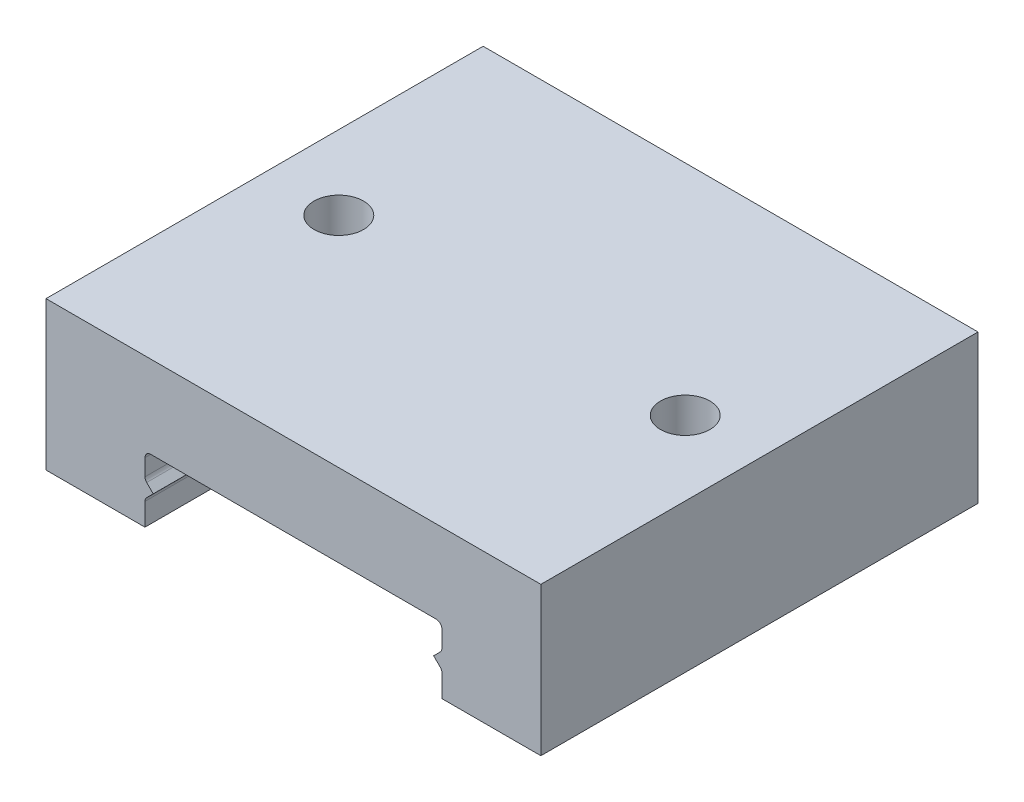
ISO-10303-21;
HEADER;
FILE_DESCRIPTION(('STEP AP214'),'2;1');
FILE_NAME('part.step','',(''),(''),'','','');
FILE_SCHEMA(('AUTOMOTIVE_DESIGN { 1 0 10303 214 1 1 1 1 }'));
ENDSEC;
DATA;
#1=APPLICATION_CONTEXT('core data for automotive mechanical design processes');
#2=APPLICATION_PROTOCOL_DEFINITION('international standard','automotive_design',2000,#1);
#3=PRODUCT_CONTEXT('',#1,'mechanical');
#4=PRODUCT('Part','Part','',(#3));
#5=PRODUCT_RELATED_PRODUCT_CATEGORY('part','',(#4));
#6=PRODUCT_DEFINITION_FORMATION('','',#4);
#7=PRODUCT_DEFINITION_CONTEXT('part definition',#1,'design');
#8=PRODUCT_DEFINITION('design','',#6,#7);
#9=PRODUCT_DEFINITION_SHAPE('','',#8);
#10=(LENGTH_UNIT() NAMED_UNIT(*) SI_UNIT(.MILLI.,.METRE.));
#11=(NAMED_UNIT(*) PLANE_ANGLE_UNIT() SI_UNIT($,.RADIAN.));
#12=(NAMED_UNIT(*) SI_UNIT($,.STERADIAN.) SOLID_ANGLE_UNIT());
#13=UNCERTAINTY_MEASURE_WITH_UNIT(LENGTH_MEASURE(1.E-05),#10,'distance_accuracy_value','');
#14=(GEOMETRIC_REPRESENTATION_CONTEXT(3) GLOBAL_UNCERTAINTY_ASSIGNED_CONTEXT((#13)) GLOBAL_UNIT_ASSIGNED_CONTEXT((#10,
#11,#12)) REPRESENTATION_CONTEXT('',''));
#15=CARTESIAN_POINT('',(0.,0.,0.));
#16=DIRECTION('',(0.,0.,1.));
#17=DIRECTION('',(1.,0.,0.));
#18=AXIS2_PLACEMENT_3D('',#15,#16,#17);
#19=CARTESIAN_POINT('',(-15.0000000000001,3.00000000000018,26.5));
#20=DIRECTION('',(0.,1.,0.));
#21=DIRECTION('',(0.,0.,1.));
#22=AXIS2_PLACEMENT_3D('',#19,#20,#21);
#23=PLANE('',#22);
#24=DIRECTION('',(0.,0.,1.));
#25=VECTOR('',#24,1.);
#26=CARTESIAN_POINT('',(8.99999999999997,3.00000000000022,26.5));
#27=LINE('',#26,#25);
#28=CARTESIAN_POINT('',(9.,3.00000000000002,0.));
#29=VERTEX_POINT('',#28);
#30=CARTESIAN_POINT('',(8.99999999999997,3.00000000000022,26.5));
#31=VERTEX_POINT('',#30);
#32=EDGE_CURVE('E239',#29,#31,#27,.T.);
#33=ORIENTED_EDGE('',*,*,#32,.F.);
#34=DIRECTION('',(1.,0.,0.));
#35=VECTOR('',#34,1.);
#36=CARTESIAN_POINT('',(-15.,3.00000000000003,0.));
#37=LINE('',#36,#35);
#38=CARTESIAN_POINT('',(15.,3.,0.));
#39=VERTEX_POINT('',#38);
#40=EDGE_CURVE('E275',#29,#39,#37,.T.);
#41=ORIENTED_EDGE('',*,*,#40,.T.);
#42=DIRECTION('',(0.,0.,-1.));
#43=VECTOR('',#42,1.);
#44=CARTESIAN_POINT('',(15.,2.99999999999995,26.5));
#45=LINE('',#44,#43);
#46=CARTESIAN_POINT('',(15.,2.99999999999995,26.5));
#47=VERTEX_POINT('',#46);
#48=EDGE_CURVE('E300',#47,#39,#45,.T.);
#49=ORIENTED_EDGE('',*,*,#48,.F.);
#50=DIRECTION('',(1.,0.,0.));
#51=VECTOR('',#50,1.);
#52=CARTESIAN_POINT('',(-15.0000000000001,3.00000000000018,26.5));
#53=LINE('',#52,#51);
#54=EDGE_CURVE('E286',#31,#47,#53,.T.);
#55=ORIENTED_EDGE('',*,*,#54,.F.);
#56=EDGE_LOOP('',(#33,#41,#49,#55));
#57=FACE_BOUND('',#56,.T.);
#58=ADVANCED_FACE('F42',(#57),#23,.F.);
#59=CARTESIAN_POINT('',(-15.0000000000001,3.00000000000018,26.5));
#60=DIRECTION('',(0.,0.,1.));
#61=DIRECTION('',(1.,0.,0.));
#62=AXIS2_PLACEMENT_3D('',#59,#60,#61);
#63=PLANE('',#62);
#64=DIRECTION('',(-0.707106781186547,0.707106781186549,0.));
#65=VECTOR('',#64,1.);
#66=CARTESIAN_POINT('',(8.49999999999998,5.00000000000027,26.5));
#67=LINE('',#66,#65);
#68=CARTESIAN_POINT('',(8.89748737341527,4.60251262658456,26.5));
#69=VERTEX_POINT('',#68);
#70=CARTESIAN_POINT('',(8.49999999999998,5.00000000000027,26.5));
#71=VERTEX_POINT('',#70);
#72=EDGE_CURVE('E231',#69,#71,#67,.T.);
#73=ORIENTED_EDGE('',*,*,#72,.F.);
#74=CARTESIAN_POINT('',(8.65000000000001,4.3550252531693,26.5));
#75=DIRECTION('',(0.,0.,1.));
#76=DIRECTION('',(1.,0.,0.));
#77=AXIS2_PLACEMENT_3D('',#74,#75,#76);
#78=CIRCLE('',#77,0.35);
#79=CARTESIAN_POINT('',(8.99999999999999,4.35502525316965,26.5));
#80=VERTEX_POINT('',#79);
#81=EDGE_CURVE('E351',#69,#80,#78,.F.);
#82=ORIENTED_EDGE('',*,*,#81,.T.);
#83=DIRECTION('',(0.,1.,0.));
#84=VECTOR('',#83,1.);
#85=CARTESIAN_POINT('',(9.,0.830210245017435,26.5));
#86=LINE('',#85,#84);
#87=EDGE_CURVE('E233',#31,#80,#86,.T.);
#88=ORIENTED_EDGE('',*,*,#87,.F.);
#89=ORIENTED_EDGE('',*,*,#54,.T.);
#90=DIRECTION('',(0.,1.,0.));
#91=VECTOR('',#90,1.);
#92=CARTESIAN_POINT('',(15.,12.0000000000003,26.5000000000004));
#93=LINE('',#92,#91);
#94=CARTESIAN_POINT('',(15.,12.0000000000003,26.5000000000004));
#95=VERTEX_POINT('',#94);
#96=EDGE_CURVE('E290',#47,#95,#93,.T.);
#97=ORIENTED_EDGE('',*,*,#96,.T.);
#98=DIRECTION('',(-1.,0.,0.));
#99=VECTOR('',#98,1.);
#100=CARTESIAN_POINT('',(-15.,12.,26.5000000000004));
#101=LINE('',#100,#99);
#102=CARTESIAN_POINT('',(-15.,12.,26.5000000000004));
#103=VERTEX_POINT('',#102);
#104=EDGE_CURVE('E292',#95,#103,#101,.T.);
#105=ORIENTED_EDGE('',*,*,#104,.T.);
#106=DIRECTION('',(0.,-1.,0.));
#107=VECTOR('',#106,1.);
#108=CARTESIAN_POINT('',(-15.,12.,26.5000000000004));
#109=LINE('',#108,#107);
#110=CARTESIAN_POINT('',(-15.0000000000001,3.00000000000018,26.5));
#111=VERTEX_POINT('',#110);
#112=EDGE_CURVE('E283',#103,#111,#109,.T.);
#113=ORIENTED_EDGE('',*,*,#112,.T.);
#114=CARTESIAN_POINT('',(-8.99999999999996,3.0000000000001,26.5));
#115=VERTEX_POINT('',#114);
#116=EDGE_CURVE('E287',#111,#115,#53,.T.);
#117=ORIENTED_EDGE('',*,*,#116,.T.);
#118=DIRECTION('',(0.,1.,0.));
#119=VECTOR('',#118,1.);
#120=CARTESIAN_POINT('',(-8.99999999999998,0.830210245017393,26.5));
#121=LINE('',#120,#119);
#122=CARTESIAN_POINT('',(-8.99999999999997,4.35502525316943,26.5));
#123=VERTEX_POINT('',#122);
#124=EDGE_CURVE('E252',#115,#123,#121,.T.);
#125=ORIENTED_EDGE('',*,*,#124,.T.);
#126=CARTESIAN_POINT('',(-8.65000000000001,4.35502525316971,26.5));
#127=DIRECTION('',(0.,0.,1.));
#128=DIRECTION('',(1.,0.,0.));
#129=AXIS2_PLACEMENT_3D('',#126,#127,#128);
#130=CIRCLE('',#129,0.35);
#131=CARTESIAN_POINT('',(-8.89748737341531,4.60251262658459,26.5));
#132=VERTEX_POINT('',#131);
#133=EDGE_CURVE('E325',#123,#132,#130,.F.);
#134=ORIENTED_EDGE('',*,*,#133,.T.);
#135=DIRECTION('',(0.707106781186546,0.707106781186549,0.));
#136=VECTOR('',#135,1.);
#137=CARTESIAN_POINT('',(-8.5,5.00000000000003,26.5));
#138=LINE('',#137,#136);
#139=CARTESIAN_POINT('',(-8.5,5.00000000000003,26.5));
#140=VERTEX_POINT('',#139);
#141=EDGE_CURVE('E255',#132,#140,#138,.T.);
#142=ORIENTED_EDGE('',*,*,#141,.T.);
#143=DIRECTION('',(-0.707106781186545,0.707106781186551,0.));
#144=VECTOR('',#143,1.);
#145=CARTESIAN_POINT('',(-8.99999999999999,5.50000000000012,26.5));
#146=LINE('',#145,#144);
#147=CARTESIAN_POINT('',(-8.89748737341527,5.39748737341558,26.5));
#148=VERTEX_POINT('',#147);
#149=EDGE_CURVE('E257',#140,#148,#146,.T.);
#150=ORIENTED_EDGE('',*,*,#149,.T.);
#151=CARTESIAN_POINT('',(-8.64999999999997,5.64497474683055,26.5));
#152=DIRECTION('',(0.,0.,1.));
#153=DIRECTION('',(1.,0.,0.));
#154=AXIS2_PLACEMENT_3D('',#151,#152,#153);
#155=CIRCLE('',#154,0.35);
#156=CARTESIAN_POINT('',(-9.00000000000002,5.64497474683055,26.5));
#157=VERTEX_POINT('',#156);
#158=EDGE_CURVE('E333',#148,#157,#155,.F.);
#159=ORIENTED_EDGE('',*,*,#158,.T.);
#160=DIRECTION('',(0.,1.,0.));
#161=VECTOR('',#160,1.);
#162=CARTESIAN_POINT('',(-9.00000000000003,7.00000000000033,26.5000000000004));
#163=LINE('',#162,#161);
#164=CARTESIAN_POINT('',(-8.99999999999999,6.64999999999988,26.5000000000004));
#165=VERTEX_POINT('',#164);
#166=EDGE_CURVE('E260',#157,#165,#163,.T.);
#167=ORIENTED_EDGE('',*,*,#166,.T.);
#168=CARTESIAN_POINT('',(-8.65000000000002,6.65000000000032,26.5000000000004));
#169=DIRECTION('',(0.,0.,1.));
#170=DIRECTION('',(1.,0.,0.));
#171=AXIS2_PLACEMENT_3D('',#168,#169,#170);
#172=CIRCLE('',#171,0.35);
#173=CARTESIAN_POINT('',(-8.65000000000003,7.00000000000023,26.5000000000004));
#174=VERTEX_POINT('',#173);
#175=EDGE_CURVE('E329',#165,#174,#172,.F.);
#176=ORIENTED_EDGE('',*,*,#175,.T.);
#177=DIRECTION('',(1.,0.,0.));
#178=VECTOR('',#177,1.);
#179=CARTESIAN_POINT('',(0.,7.00000000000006,26.5000000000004));
#180=LINE('',#179,#178);
#181=CARTESIAN_POINT('',(8.65000000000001,7.0000000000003,26.5000000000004));
#182=VERTEX_POINT('',#181);
#183=EDGE_CURVE('E263',#174,#182,#180,.T.);
#184=ORIENTED_EDGE('',*,*,#183,.T.);
#185=CARTESIAN_POINT('',(8.65000000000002,6.64999999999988,26.5000000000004));
#186=DIRECTION('',(0.,0.,1.));
#187=DIRECTION('',(1.,0.,0.));
#188=AXIS2_PLACEMENT_3D('',#185,#186,#187);
#189=CIRCLE('',#188,0.35);
#190=CARTESIAN_POINT('',(9.00000000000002,6.65000000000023,26.5000000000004));
#191=VERTEX_POINT('',#190);
#192=EDGE_CURVE('E355',#182,#191,#189,.F.);
#193=ORIENTED_EDGE('',*,*,#192,.T.);
#194=DIRECTION('',(0.,1.,0.));
#195=VECTOR('',#194,1.);
#196=CARTESIAN_POINT('',(9.00000000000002,6.9999999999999,26.5000000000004));
#197=LINE('',#196,#195);
#198=CARTESIAN_POINT('',(8.99999999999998,5.64497474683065,26.5));
#199=VERTEX_POINT('',#198);
#200=EDGE_CURVE('E226',#199,#191,#197,.T.);
#201=ORIENTED_EDGE('',*,*,#200,.F.);
#202=CARTESIAN_POINT('',(8.65,5.64497474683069,26.5));
#203=DIRECTION('',(0.,0.,1.));
#204=DIRECTION('',(1.,0.,0.));
#205=AXIS2_PLACEMENT_3D('',#202,#203,#204);
#206=CIRCLE('',#205,0.35);
#207=CARTESIAN_POINT('',(8.89748737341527,5.39748737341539,26.5));
#208=VERTEX_POINT('',#207);
#209=EDGE_CURVE('E13',#199,#208,#206,.F.);
#210=ORIENTED_EDGE('',*,*,#209,.T.);
#211=DIRECTION('',(0.707106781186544,0.707106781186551,0.));
#212=VECTOR('',#211,1.);
#213=CARTESIAN_POINT('',(8.99999999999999,5.49999999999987,26.5));
#214=LINE('',#213,#212);
#215=EDGE_CURVE('E229',#71,#208,#214,.T.);
#216=ORIENTED_EDGE('',*,*,#215,.F.);
#217=EDGE_LOOP('',(#73,#82,#88,#89,#97,#105,#113,#117,#125,#134,#142,#150,#159,#167,#176,#184,
#193,#201,#210,#216));
#218=FACE_BOUND('',#217,.T.);
#219=ADVANCED_FACE('F368',(#218),#63,.T.);
#220=CARTESIAN_POINT('',(-15.,3.00000000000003,0.));
#221=DIRECTION('',(0.,0.,1.));
#222=DIRECTION('',(1.,0.,0.));
#223=AXIS2_PLACEMENT_3D('',#220,#221,#222);
#224=PLANE('',#223);
#225=DIRECTION('',(0.,1.,0.));
#226=VECTOR('',#225,1.);
#227=CARTESIAN_POINT('',(8.99999999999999,0.830210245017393,0.));
#228=LINE('',#227,#226);
#229=CARTESIAN_POINT('',(9.,4.35502525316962,0.));
#230=VERTEX_POINT('',#229);
#231=EDGE_CURVE('E223',#29,#230,#228,.T.);
#232=ORIENTED_EDGE('',*,*,#231,.T.);
#233=CARTESIAN_POINT('',(8.65,4.35502525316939,0.));
#234=DIRECTION('',(0.,0.,1.));
#235=DIRECTION('',(1.,0.,0.));
#236=AXIS2_PLACEMENT_3D('',#233,#234,#235);
#237=CIRCLE('',#236,0.35);
#238=CARTESIAN_POINT('',(8.89748737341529,4.60251262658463,0.));
#239=VERTEX_POINT('',#238);
#240=EDGE_CURVE('E349',#230,#239,#237,.T.);
#241=ORIENTED_EDGE('',*,*,#240,.T.);
#242=DIRECTION('',(-0.707106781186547,0.707106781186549,0.));
#243=VECTOR('',#242,1.);
#244=CARTESIAN_POINT('',(8.5,5.00000000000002,0.));
#245=LINE('',#244,#243);
#246=CARTESIAN_POINT('',(8.5,5.00000000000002,0.));
#247=VERTEX_POINT('',#246);
#248=EDGE_CURVE('E221',#239,#247,#245,.T.);
#249=ORIENTED_EDGE('',*,*,#248,.T.);
#250=DIRECTION('',(0.707106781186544,0.707106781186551,0.));
#251=VECTOR('',#250,1.);
#252=CARTESIAN_POINT('',(8.99999999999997,5.49999999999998,0.));
#253=LINE('',#252,#251);
#254=CARTESIAN_POINT('',(8.8974873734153,5.39748737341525,0.));
#255=VERTEX_POINT('',#254);
#256=EDGE_CURVE('E218',#247,#255,#253,.T.);
#257=ORIENTED_EDGE('',*,*,#256,.T.);
#258=CARTESIAN_POINT('',(8.64999999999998,5.64497474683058,0.));
#259=DIRECTION('',(0.,0.,1.));
#260=DIRECTION('',(1.,0.,0.));
#261=AXIS2_PLACEMENT_3D('',#258,#259,#260);
#262=CIRCLE('',#261,0.35);
#263=CARTESIAN_POINT('',(9.00000000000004,5.64497474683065,0.));
#264=VERTEX_POINT('',#263);
#265=EDGE_CURVE('E50',#255,#264,#262,.T.);
#266=ORIENTED_EDGE('',*,*,#265,.T.);
#267=DIRECTION('',(0.,1.,0.));
#268=VECTOR('',#267,1.);
#269=CARTESIAN_POINT('',(9.,7.00000000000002,4.44089209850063E-13));
#270=LINE('',#269,#268);
#271=CARTESIAN_POINT('',(9.00000000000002,6.65000000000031,4.44089209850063E-13));
#272=VERTEX_POINT('',#271);
#273=EDGE_CURVE('E215',#264,#272,#270,.T.);
#274=ORIENTED_EDGE('',*,*,#273,.T.);
#275=CARTESIAN_POINT('',(8.64999999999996,6.65000000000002,4.44089209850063E-13));
#276=DIRECTION('',(0.,0.,1.));
#277=DIRECTION('',(1.,0.,0.));
#278=AXIS2_PLACEMENT_3D('',#275,#276,#277);
#279=CIRCLE('',#278,0.35);
#280=CARTESIAN_POINT('',(8.65,6.99999999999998,4.44089209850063E-13));
#281=VERTEX_POINT('',#280);
#282=EDGE_CURVE('E353',#272,#281,#279,.T.);
#283=ORIENTED_EDGE('',*,*,#282,.T.);
#284=DIRECTION('',(1.,0.,0.));
#285=VECTOR('',#284,1.);
#286=CARTESIAN_POINT('',(0.,7.00000000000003,4.44089209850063E-13));
#287=LINE('',#286,#285);
#288=CARTESIAN_POINT('',(-8.65000000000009,7.00000000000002,4.44089209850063E-13));
#289=VERTEX_POINT('',#288);
#290=EDGE_CURVE('E249',#289,#281,#287,.T.);
#291=ORIENTED_EDGE('',*,*,#290,.F.);
#292=CARTESIAN_POINT('',(-8.64999999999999,6.65,4.44089209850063E-13));
#293=DIRECTION('',(0.,0.,1.));
#294=DIRECTION('',(1.,0.,0.));
#295=AXIS2_PLACEMENT_3D('',#292,#293,#294);
#296=CIRCLE('',#295,0.35);
#297=CARTESIAN_POINT('',(-9.00000000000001,6.64999999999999,4.44089209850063E-13));
#298=VERTEX_POINT('',#297);
#299=EDGE_CURVE('E327',#289,#298,#296,.T.);
#300=ORIENTED_EDGE('',*,*,#299,.T.);
#301=DIRECTION('',(0.,1.,0.));
#302=VECTOR('',#301,1.);
#303=CARTESIAN_POINT('',(-8.99999999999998,6.99999999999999,4.44089209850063E-13));
#304=LINE('',#303,#302);
#305=CARTESIAN_POINT('',(-9.00000000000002,5.64497474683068,0.));
#306=VERTEX_POINT('',#305);
#307=EDGE_CURVE('E246',#306,#298,#304,.T.);
#308=ORIENTED_EDGE('',*,*,#307,.F.);
#309=CARTESIAN_POINT('',(-8.64999999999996,5.64497474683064,0.));
#310=DIRECTION('',(0.,0.,1.));
#311=DIRECTION('',(1.,0.,0.));
#312=AXIS2_PLACEMENT_3D('',#309,#310,#311);
#313=CIRCLE('',#312,0.35);
#314=CARTESIAN_POINT('',(-8.89748737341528,5.39748737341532,0.));
#315=VERTEX_POINT('',#314);
#316=EDGE_CURVE('E331',#306,#315,#313,.T.);
#317=ORIENTED_EDGE('',*,*,#316,.T.);
#318=DIRECTION('',(-0.707106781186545,0.707106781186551,0.));
#319=VECTOR('',#318,1.);
#320=CARTESIAN_POINT('',(-9.00000000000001,5.49999999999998,0.));
#321=LINE('',#320,#319);
#322=CARTESIAN_POINT('',(-8.50000000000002,5.00000000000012,0.));
#323=VERTEX_POINT('',#322);
#324=EDGE_CURVE('E243',#323,#315,#321,.T.);
#325=ORIENTED_EDGE('',*,*,#324,.F.);
#326=DIRECTION('',(0.707106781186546,0.707106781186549,0.));
#327=VECTOR('',#326,1.);
#328=CARTESIAN_POINT('',(-8.50000000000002,5.00000000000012,0.));
#329=LINE('',#328,#327);
#330=CARTESIAN_POINT('',(-8.89748737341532,4.60251262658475,0.));
#331=VERTEX_POINT('',#330);
#332=EDGE_CURVE('E241',#331,#323,#329,.T.);
#333=ORIENTED_EDGE('',*,*,#332,.F.);
#334=CARTESIAN_POINT('',(-8.65000000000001,4.35502525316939,0.));
#335=DIRECTION('',(0.,0.,1.));
#336=DIRECTION('',(1.,0.,0.));
#337=AXIS2_PLACEMENT_3D('',#334,#335,#336);
#338=CIRCLE('',#337,0.35);
#339=CARTESIAN_POINT('',(-8.99999999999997,4.35502525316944,0.));
#340=VERTEX_POINT('',#339);
#341=EDGE_CURVE('E323',#331,#340,#338,.T.);
#342=ORIENTED_EDGE('',*,*,#341,.T.);
#343=DIRECTION('',(0.,-1.,0.));
#344=VECTOR('',#343,1.);
#345=CARTESIAN_POINT('',(-8.99999999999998,3.,0.));
#346=LINE('',#345,#344);
#347=CARTESIAN_POINT('',(-8.99999999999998,3.,0.));
#348=VERTEX_POINT('',#347);
#349=EDGE_CURVE('E306',#340,#348,#346,.T.);
#350=ORIENTED_EDGE('',*,*,#349,.T.);
#351=CARTESIAN_POINT('',(-15.,3.00000000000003,0.));
#352=VERTEX_POINT('',#351);
#353=EDGE_CURVE('E276',#352,#348,#37,.T.);
#354=ORIENTED_EDGE('',*,*,#353,.F.);
#355=DIRECTION('',(0.,-1.,0.));
#356=VECTOR('',#355,1.);
#357=CARTESIAN_POINT('',(-15.,12.0000000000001,4.44089209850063E-13));
#358=LINE('',#357,#356);
#359=CARTESIAN_POINT('',(-15.,12.0000000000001,4.44089209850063E-13));
#360=VERTEX_POINT('',#359);
#361=EDGE_CURVE('E272',#360,#352,#358,.T.);
#362=ORIENTED_EDGE('',*,*,#361,.F.);
#363=DIRECTION('',(-1.,0.,0.));
#364=VECTOR('',#363,1.);
#365=CARTESIAN_POINT('',(-15.,12.0000000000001,4.44089209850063E-13));
#366=LINE('',#365,#364);
#367=CARTESIAN_POINT('',(15.,12.0000000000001,4.44089209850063E-13));
#368=VERTEX_POINT('',#367);
#369=EDGE_CURVE('E281',#368,#360,#366,.T.);
#370=ORIENTED_EDGE('',*,*,#369,.F.);
#371=DIRECTION('',(0.,1.,0.));
#372=VECTOR('',#371,1.);
#373=CARTESIAN_POINT('',(15.,12.0000000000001,4.44089209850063E-13));
#374=LINE('',#373,#372);
#375=EDGE_CURVE('E279',#39,#368,#374,.T.);
#376=ORIENTED_EDGE('',*,*,#375,.F.);
#377=ORIENTED_EDGE('',*,*,#40,.F.);
#378=EDGE_LOOP('',(#232,#241,#249,#257,#266,#274,#283,#291,#300,#308,#317,#325,#333,#342,#350,
#354,#362,#370,#376,#377));
#379=FACE_BOUND('',#378,.T.);
#380=ADVANCED_FACE('F358',(#379),#224,.F.);
#381=CARTESIAN_POINT('',(-15.,12.,26.5000000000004));
#382=DIRECTION('',(1.,0.,0.));
#383=DIRECTION('',(0.,1.,0.));
#384=AXIS2_PLACEMENT_3D('',#381,#382,#383);
#385=PLANE('',#384);
#386=ORIENTED_EDGE('',*,*,#361,.T.);
#387=DIRECTION('',(0.,0.,-1.));
#388=VECTOR('',#387,1.);
#389=CARTESIAN_POINT('',(-15.0000000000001,3.00000000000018,26.5));
#390=LINE('',#389,#388);
#391=EDGE_CURVE('E303',#111,#352,#390,.T.);
#392=ORIENTED_EDGE('',*,*,#391,.F.);
#393=ORIENTED_EDGE('',*,*,#112,.F.);
#394=DIRECTION('',(0.,0.,-1.));
#395=VECTOR('',#394,1.);
#396=CARTESIAN_POINT('',(-15.,12.,26.5000000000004));
#397=LINE('',#396,#395);
#398=EDGE_CURVE('E294',#103,#360,#397,.T.);
#399=ORIENTED_EDGE('',*,*,#398,.T.);
#400=EDGE_LOOP('',(#386,#392,#393,#399));
#401=FACE_BOUND('',#400,.T.);
#402=ADVANCED_FACE('F44',(#401),#385,.F.);
#403=ORIENTED_EDGE('',*,*,#353,.T.);
#404=DIRECTION('',(0.,0.,1.));
#405=VECTOR('',#404,1.);
#406=CARTESIAN_POINT('',(-8.99999999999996,3.0000000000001,26.5));
#407=LINE('',#406,#405);
#408=EDGE_CURVE('E269',#348,#115,#407,.T.);
#409=ORIENTED_EDGE('',*,*,#408,.T.);
#410=ORIENTED_EDGE('',*,*,#116,.F.);
#411=ORIENTED_EDGE('',*,*,#391,.T.);
#412=EDGE_LOOP('',(#403,#409,#410,#411));
#413=FACE_BOUND('',#412,.T.);
#414=ADVANCED_FACE('F399',(#413),#23,.F.);
#415=CARTESIAN_POINT('',(15.,12.0000000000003,26.5000000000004));
#416=DIRECTION('',(-1.,0.,0.));
#417=DIRECTION('',(0.,-1.,0.));
#418=AXIS2_PLACEMENT_3D('',#415,#416,#417);
#419=PLANE('',#418);
#420=ORIENTED_EDGE('',*,*,#375,.T.);
#421=DIRECTION('',(0.,0.,-1.));
#422=VECTOR('',#421,1.);
#423=CARTESIAN_POINT('',(15.,12.0000000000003,26.5000000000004));
#424=LINE('',#423,#422);
#425=EDGE_CURVE('E297',#95,#368,#424,.T.);
#426=ORIENTED_EDGE('',*,*,#425,.F.);
#427=ORIENTED_EDGE('',*,*,#96,.F.);
#428=ORIENTED_EDGE('',*,*,#48,.T.);
#429=EDGE_LOOP('',(#420,#426,#427,#428));
#430=FACE_BOUND('',#429,.T.);
#431=ADVANCED_FACE('F388',(#430),#419,.F.);
#432=CARTESIAN_POINT('',(-15.,12.,26.5000000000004));
#433=DIRECTION('',(0.,-1.,0.));
#434=DIRECTION('',(0.,0.,-1.));
#435=AXIS2_PLACEMENT_3D('',#432,#433,#434);
#436=PLANE('',#435);
#437=CARTESIAN_POINT('',(10.5000000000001,12.0000000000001,13.2500000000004));
#438=DIRECTION('',(0.,1.,0.));
#439=DIRECTION('',(0.,0.,1.));
#440=AXIS2_PLACEMENT_3D('',#437,#438,#439);
#441=CIRCLE('',#440,1.5);
#442=CARTESIAN_POINT('',(10.5000000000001,12.0000000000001,14.7500000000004));
#443=VERTEX_POINT('',#442);
#444=EDGE_CURVE('E200',#443,#443,#441,.T.);
#445=ORIENTED_EDGE('',*,*,#444,.F.);
#446=EDGE_LOOP('',(#445));
#447=FACE_BOUND('',#446,.T.);
#448=CARTESIAN_POINT('',(-10.5,12.0000000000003,13.2500000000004));
#449=DIRECTION('',(0.,1.,0.));
#450=DIRECTION('',(0.,0.,1.));
#451=AXIS2_PLACEMENT_3D('',#448,#449,#450);
#452=CIRCLE('',#451,1.5);
#453=CARTESIAN_POINT('',(-10.5,12.0000000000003,14.7500000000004));
#454=VERTEX_POINT('',#453);
#455=EDGE_CURVE('E212',#454,#454,#452,.T.);
#456=ORIENTED_EDGE('',*,*,#455,.F.);
#457=EDGE_LOOP('',(#456));
#458=FACE_BOUND('',#457,.T.);
#459=ORIENTED_EDGE('',*,*,#369,.T.);
#460=ORIENTED_EDGE('',*,*,#398,.F.);
#461=ORIENTED_EDGE('',*,*,#104,.F.);
#462=ORIENTED_EDGE('',*,*,#425,.T.);
#463=EDGE_LOOP('',(#459,#460,#461,#462));
#464=FACE_BOUND('',#463,.T.);
#465=ADVANCED_FACE('F395',(#447,#458,#464),#436,.F.);
#466=CARTESIAN_POINT('',(-8.99999999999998,0.830210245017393,26.5));
#467=DIRECTION('',(-1.,0.,0.));
#468=DIRECTION('',(0.,0.,1.));
#469=AXIS2_PLACEMENT_3D('',#466,#467,#468);
#470=PLANE('',#469);
#471=ORIENTED_EDGE('',*,*,#349,.F.);
#472=DIRECTION('',(0.,0.,-1.));
#473=VECTOR('',#472,1.);
#474=CARTESIAN_POINT('',(-8.99999999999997,4.35502525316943,26.5));
#475=LINE('',#474,#473);
#476=EDGE_CURVE('E311',#340,#123,#475,.F.);
#477=ORIENTED_EDGE('',*,*,#476,.T.);
#478=ORIENTED_EDGE('',*,*,#124,.F.);
#479=ORIENTED_EDGE('',*,*,#408,.F.);
#480=EDGE_LOOP('',(#471,#477,#478,#479));
#481=FACE_BOUND('',#480,.T.);
#482=ADVANCED_FACE('F466',(#481),#470,.F.);
#483=CARTESIAN_POINT('',(0.,7.00000000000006,26.5000000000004));
#484=DIRECTION('',(0.,1.,0.));
#485=DIRECTION('',(0.,0.,1.));
#486=AXIS2_PLACEMENT_3D('',#483,#484,#485);
#487=PLANE('',#486);
#488=ORIENTED_EDGE('',*,*,#290,.T.);
#489=DIRECTION('',(0.,0.,-1.));
#490=VECTOR('',#489,1.);
#491=CARTESIAN_POINT('',(8.65000000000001,7.0000000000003,26.5000000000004));
#492=LINE('',#491,#490);
#493=EDGE_CURVE('E345',#281,#182,#492,.F.);
#494=ORIENTED_EDGE('',*,*,#493,.T.);
#495=ORIENTED_EDGE('',*,*,#183,.F.);
#496=DIRECTION('',(0.,0.,-1.));
#497=VECTOR('',#496,1.);
#498=CARTESIAN_POINT('',(-8.65000000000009,7.00000000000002,4.44089209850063E-13));
#499=LINE('',#498,#497);
#500=EDGE_CURVE('E313',#174,#289,#499,.T.);
#501=ORIENTED_EDGE('',*,*,#500,.T.);
#502=EDGE_LOOP('',(#488,#494,#495,#501));
#503=FACE_BOUND('',#502,.T.);
#504=ADVANCED_FACE('F434',(#503),#487,.F.);
#505=CARTESIAN_POINT('',(-9.00000000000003,7.00000000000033,26.5000000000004));
#506=DIRECTION('',(-1.,0.,0.));
#507=DIRECTION('',(0.,-1.,0.));
#508=AXIS2_PLACEMENT_3D('',#505,#506,#507);
#509=PLANE('',#508);
#510=ORIENTED_EDGE('',*,*,#307,.T.);
#511=DIRECTION('',(0.,0.,-1.));
#512=VECTOR('',#511,1.);
#513=CARTESIAN_POINT('',(-8.99999999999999,6.64999999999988,26.5000000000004));
#514=LINE('',#513,#512);
#515=EDGE_CURVE('E319',#298,#165,#514,.F.);
#516=ORIENTED_EDGE('',*,*,#515,.T.);
#517=ORIENTED_EDGE('',*,*,#166,.F.);
#518=DIRECTION('',(0.,0.,-1.));
#519=VECTOR('',#518,1.);
#520=CARTESIAN_POINT('',(-9.00000000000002,5.64497474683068,0.));
#521=LINE('',#520,#519);
#522=EDGE_CURVE('E316',#157,#306,#521,.T.);
#523=ORIENTED_EDGE('',*,*,#522,.T.);
#524=EDGE_LOOP('',(#510,#516,#517,#523));
#525=FACE_BOUND('',#524,.T.);
#526=ADVANCED_FACE('F426',(#525),#509,.F.);
#527=CARTESIAN_POINT('',(-8.99999999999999,5.50000000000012,26.5));
#528=DIRECTION('',(-0.707106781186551,-0.707106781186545,0.));
#529=DIRECTION('',(0.707106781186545,-0.707106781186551,0.));
#530=AXIS2_PLACEMENT_3D('',#527,#528,#529);
#531=PLANE('',#530);
#532=ORIENTED_EDGE('',*,*,#324,.T.);
#533=DIRECTION('',(0.,0.,-1.));
#534=VECTOR('',#533,1.);
#535=CARTESIAN_POINT('',(-8.89748737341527,5.39748737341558,26.5));
#536=LINE('',#535,#534);
#537=EDGE_CURVE('E321',#315,#148,#536,.F.);
#538=ORIENTED_EDGE('',*,*,#537,.T.);
#539=ORIENTED_EDGE('',*,*,#149,.F.);
#540=DIRECTION('',(0.,0.,-1.));
#541=VECTOR('',#540,1.);
#542=CARTESIAN_POINT('',(-8.5,5.00000000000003,26.5));
#543=LINE('',#542,#541);
#544=EDGE_CURVE('E266',#140,#323,#543,.T.);
#545=ORIENTED_EDGE('',*,*,#544,.T.);
#546=EDGE_LOOP('',(#532,#538,#539,#545));
#547=FACE_BOUND('',#546,.T.);
#548=ADVANCED_FACE('F417',(#547),#531,.F.);
#549=CARTESIAN_POINT('',(-8.5,5.00000000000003,26.5));
#550=DIRECTION('',(-0.707106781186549,0.707106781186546,0.));
#551=DIRECTION('',(-0.707106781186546,-0.707106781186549,0.));
#552=AXIS2_PLACEMENT_3D('',#549,#550,#551);
#553=PLANE('',#552);
#554=ORIENTED_EDGE('',*,*,#141,.F.);
#555=DIRECTION('',(0.,0.,-1.));
#556=VECTOR('',#555,1.);
#557=CARTESIAN_POINT('',(-8.89748737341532,4.60251262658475,0.));
#558=LINE('',#557,#556);
#559=EDGE_CURVE('E308',#132,#331,#558,.T.);
#560=ORIENTED_EDGE('',*,*,#559,.T.);
#561=ORIENTED_EDGE('',*,*,#332,.T.);
#562=ORIENTED_EDGE('',*,*,#544,.F.);
#563=EDGE_LOOP('',(#554,#560,#561,#562));
#564=FACE_BOUND('',#563,.T.);
#565=ADVANCED_FACE('F410',(#564),#553,.F.);
#566=CARTESIAN_POINT('',(-8.65000000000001,4.35502525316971,26.5));
#567=DIRECTION('',(0.,0.,1.));
#568=DIRECTION('',(1.,0.,0.));
#569=AXIS2_PLACEMENT_3D('',#566,#567,#568);
#570=CYLINDRICAL_SURFACE('',#569,0.35);
#571=ORIENTED_EDGE('',*,*,#133,.F.);
#572=ORIENTED_EDGE('',*,*,#476,.F.);
#573=ORIENTED_EDGE('',*,*,#341,.F.);
#574=ORIENTED_EDGE('',*,*,#559,.F.);
#575=EDGE_LOOP('',(#571,#572,#573,#574));
#576=FACE_BOUND('',#575,.T.);
#577=ADVANCED_FACE('F407',(#576),#570,.F.);
#578=CARTESIAN_POINT('',(-8.65000000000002,6.65000000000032,26.5000000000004));
#579=DIRECTION('',(0.,0.,1.));
#580=DIRECTION('',(1.,0.,0.));
#581=AXIS2_PLACEMENT_3D('',#578,#579,#580);
#582=CYLINDRICAL_SURFACE('',#581,0.35);
#583=ORIENTED_EDGE('',*,*,#175,.F.);
#584=ORIENTED_EDGE('',*,*,#515,.F.);
#585=ORIENTED_EDGE('',*,*,#299,.F.);
#586=ORIENTED_EDGE('',*,*,#500,.F.);
#587=EDGE_LOOP('',(#583,#584,#585,#586));
#588=FACE_BOUND('',#587,.T.);
#589=ADVANCED_FACE('F429',(#588),#582,.F.);
#590=CARTESIAN_POINT('',(-8.64999999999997,5.64497474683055,26.5));
#591=DIRECTION('',(0.,0.,1.));
#592=DIRECTION('',(1.,0.,0.));
#593=AXIS2_PLACEMENT_3D('',#590,#591,#592);
#594=CYLINDRICAL_SURFACE('',#593,0.35);
#595=ORIENTED_EDGE('',*,*,#158,.F.);
#596=ORIENTED_EDGE('',*,*,#537,.F.);
#597=ORIENTED_EDGE('',*,*,#316,.F.);
#598=ORIENTED_EDGE('',*,*,#522,.F.);
#599=EDGE_LOOP('',(#595,#596,#597,#598));
#600=FACE_BOUND('',#599,.T.);
#601=ADVANCED_FACE('F421',(#600),#594,.F.);
#602=CARTESIAN_POINT('',(9.,0.830210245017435,26.5));
#603=DIRECTION('',(-1.,0.,0.));
#604=DIRECTION('',(0.,0.,1.));
#605=AXIS2_PLACEMENT_3D('',#602,#603,#604);
#606=PLANE('',#605);
#607=ORIENTED_EDGE('',*,*,#87,.T.);
#608=DIRECTION('',(0.,0.,-1.));
#609=VECTOR('',#608,1.);
#610=CARTESIAN_POINT('',(9.,4.35502525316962,0.));
#611=LINE('',#610,#609);
#612=EDGE_CURVE('E335',#80,#230,#611,.T.);
#613=ORIENTED_EDGE('',*,*,#612,.T.);
#614=ORIENTED_EDGE('',*,*,#231,.F.);
#615=ORIENTED_EDGE('',*,*,#32,.T.);
#616=EDGE_LOOP('',(#607,#613,#614,#615));
#617=FACE_BOUND('',#616,.T.);
#618=ADVANCED_FACE('F377',(#617),#606,.T.);
#619=CARTESIAN_POINT('',(8.49999999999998,5.00000000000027,26.5));
#620=DIRECTION('',(-0.707106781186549,-0.707106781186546,0.));
#621=DIRECTION('',(0.707106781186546,-0.707106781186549,0.));
#622=AXIS2_PLACEMENT_3D('',#619,#620,#621);
#623=PLANE('',#622);
#624=ORIENTED_EDGE('',*,*,#248,.F.);
#625=DIRECTION('',(0.,0.,-1.));
#626=VECTOR('',#625,1.);
#627=CARTESIAN_POINT('',(8.89748737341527,4.60251262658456,26.5));
#628=LINE('',#627,#626);
#629=EDGE_CURVE('E338',#239,#69,#628,.F.);
#630=ORIENTED_EDGE('',*,*,#629,.T.);
#631=ORIENTED_EDGE('',*,*,#72,.T.);
#632=DIRECTION('',(0.,0.,-1.));
#633=VECTOR('',#632,1.);
#634=CARTESIAN_POINT('',(8.49999999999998,5.00000000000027,26.5));
#635=LINE('',#634,#633);
#636=EDGE_CURVE('E236',#71,#247,#635,.T.);
#637=ORIENTED_EDGE('',*,*,#636,.T.);
#638=EDGE_LOOP('',(#624,#630,#631,#637));
#639=FACE_BOUND('',#638,.T.);
#640=ADVANCED_FACE('F562',(#639),#623,.T.);
#641=CARTESIAN_POINT('',(8.99999999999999,5.49999999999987,26.5));
#642=DIRECTION('',(-0.707106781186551,0.707106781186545,0.));
#643=DIRECTION('',(-0.707106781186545,-0.707106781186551,0.));
#644=AXIS2_PLACEMENT_3D('',#641,#642,#643);
#645=PLANE('',#644);
#646=ORIENTED_EDGE('',*,*,#215,.T.);
#647=DIRECTION('',(0.,0.,-1.));
#648=VECTOR('',#647,1.);
#649=CARTESIAN_POINT('',(8.8974873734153,5.39748737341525,0.));
#650=LINE('',#649,#648);
#651=EDGE_CURVE('E347',#208,#255,#650,.T.);
#652=ORIENTED_EDGE('',*,*,#651,.T.);
#653=ORIENTED_EDGE('',*,*,#256,.F.);
#654=ORIENTED_EDGE('',*,*,#636,.F.);
#655=EDGE_LOOP('',(#646,#652,#653,#654));
#656=FACE_BOUND('',#655,.T.);
#657=ADVANCED_FACE('F365',(#656),#645,.T.);
#658=CARTESIAN_POINT('',(9.00000000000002,6.9999999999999,26.5000000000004));
#659=DIRECTION('',(-1.,0.,0.));
#660=DIRECTION('',(0.,-1.,0.));
#661=AXIS2_PLACEMENT_3D('',#658,#659,#660);
#662=PLANE('',#661);
#663=ORIENTED_EDGE('',*,*,#200,.T.);
#664=DIRECTION('',(0.,0.,-1.));
#665=VECTOR('',#664,1.);
#666=CARTESIAN_POINT('',(9.00000000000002,6.65000000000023,26.5000000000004));
#667=LINE('',#666,#665);
#668=EDGE_CURVE('E342',#191,#272,#667,.T.);
#669=ORIENTED_EDGE('',*,*,#668,.T.);
#670=ORIENTED_EDGE('',*,*,#273,.F.);
#671=DIRECTION('',(0.,0.,-1.));
#672=VECTOR('',#671,1.);
#673=CARTESIAN_POINT('',(8.99999999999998,5.64497474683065,26.5));
#674=LINE('',#673,#672);
#675=EDGE_CURVE('E340',#264,#199,#674,.F.);
#676=ORIENTED_EDGE('',*,*,#675,.T.);
#677=EDGE_LOOP('',(#663,#669,#670,#676));
#678=FACE_BOUND('',#677,.T.);
#679=ADVANCED_FACE('F361',(#678),#662,.T.);
#680=CARTESIAN_POINT('',(8.65000000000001,4.3550252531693,26.5));
#681=DIRECTION('',(0.,0.,1.));
#682=DIRECTION('',(1.,0.,0.));
#683=AXIS2_PLACEMENT_3D('',#680,#681,#682);
#684=CYLINDRICAL_SURFACE('',#683,0.35);
#685=ORIENTED_EDGE('',*,*,#81,.F.);
#686=ORIENTED_EDGE('',*,*,#629,.F.);
#687=ORIENTED_EDGE('',*,*,#240,.F.);
#688=ORIENTED_EDGE('',*,*,#612,.F.);
#689=EDGE_LOOP('',(#685,#686,#687,#688));
#690=FACE_BOUND('',#689,.T.);
#691=ADVANCED_FACE('F375',(#690),#684,.F.);
#692=CARTESIAN_POINT('',(8.65000000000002,6.64999999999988,26.5000000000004));
#693=DIRECTION('',(0.,0.,-1.));
#694=DIRECTION('',(-1.,0.,0.));
#695=AXIS2_PLACEMENT_3D('',#692,#693,#694);
#696=CYLINDRICAL_SURFACE('',#695,0.35);
#697=ORIENTED_EDGE('',*,*,#192,.F.);
#698=ORIENTED_EDGE('',*,*,#493,.F.);
#699=ORIENTED_EDGE('',*,*,#282,.F.);
#700=ORIENTED_EDGE('',*,*,#668,.F.);
#701=EDGE_LOOP('',(#697,#698,#699,#700));
#702=FACE_BOUND('',#701,.T.);
#703=ADVANCED_FACE('F438',(#702),#696,.F.);
#704=CARTESIAN_POINT('',(8.65,5.64497474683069,26.5));
#705=DIRECTION('',(0.,0.,1.));
#706=DIRECTION('',(1.,0.,0.));
#707=AXIS2_PLACEMENT_3D('',#704,#705,#706);
#708=CYLINDRICAL_SURFACE('',#707,0.35);
#709=ORIENTED_EDGE('',*,*,#209,.F.);
#710=ORIENTED_EDGE('',*,*,#675,.F.);
#711=ORIENTED_EDGE('',*,*,#265,.F.);
#712=ORIENTED_EDGE('',*,*,#651,.F.);
#713=EDGE_LOOP('',(#709,#710,#711,#712));
#714=FACE_BOUND('',#713,.T.);
#715=ADVANCED_FACE('F363',(#714),#708,.F.);
#716=CARTESIAN_POINT('',(-10.5,12.0000000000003,13.2500000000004));
#717=DIRECTION('',(0.,1.,0.));
#718=DIRECTION('',(0.,0.,1.));
#719=AXIS2_PLACEMENT_3D('',#716,#717,#718);
#720=CYLINDRICAL_SURFACE('',#719,1.5);
#721=CARTESIAN_POINT('',(-10.5,8.99999999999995,13.2500000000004));
#722=DIRECTION('',(0.,1.,0.));
#723=DIRECTION('',(0.,0.,1.));
#724=AXIS2_PLACEMENT_3D('',#721,#722,#723);
#725=CIRCLE('',#724,1.5);
#726=CARTESIAN_POINT('',(-10.5,8.99999999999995,14.7500000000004));
#727=VERTEX_POINT('',#726);
#728=EDGE_CURVE('E209',#727,#727,#725,.T.);
#729=ORIENTED_EDGE('',*,*,#728,.F.);
#730=EDGE_LOOP('',(#729));
#731=FACE_BOUND('',#730,.T.);
#732=ORIENTED_EDGE('',*,*,#455,.T.);
#733=EDGE_LOOP('',(#732));
#734=FACE_BOUND('',#733,.T.);
#735=ADVANCED_FACE('F445',(#731,#734),#720,.F.);
#736=CARTESIAN_POINT('',(-9.24999999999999,8.99999999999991,13.2500000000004));
#737=DIRECTION('',(0.,-1.,0.));
#738=DIRECTION('',(0.,0.,-1.));
#739=AXIS2_PLACEMENT_3D('',#736,#737,#738);
#740=PLANE('',#739);
#741=CARTESIAN_POINT('',(-10.5,8.99999999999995,13.2500000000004));
#742=DIRECTION('',(0.,1.,0.));
#743=DIRECTION('',(0.,0.,1.));
#744=AXIS2_PLACEMENT_3D('',#741,#742,#743);
#745=CIRCLE('',#744,1.25);
#746=CARTESIAN_POINT('',(-10.5,8.99999999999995,14.5000000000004));
#747=VERTEX_POINT('',#746);
#748=EDGE_CURVE('E206',#747,#747,#745,.T.);
#749=ORIENTED_EDGE('',*,*,#748,.F.);
#750=EDGE_LOOP('',(#749));
#751=FACE_BOUND('',#750,.T.);
#752=ORIENTED_EDGE('',*,*,#728,.T.);
#753=EDGE_LOOP('',(#752));
#754=FACE_BOUND('',#753,.T.);
#755=ADVANCED_FACE('F479',(#751,#754),#740,.F.);
#756=CARTESIAN_POINT('',(-10.5,12.0000000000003,13.2500000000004));
#757=DIRECTION('',(0.,1.,0.));
#758=DIRECTION('',(0.,0.,1.));
#759=AXIS2_PLACEMENT_3D('',#756,#757,#758);
#760=CYLINDRICAL_SURFACE('',#759,1.25);
#761=CARTESIAN_POINT('',(-10.5,7.49999999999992,13.2500000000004));
#762=DIRECTION('',(0.,1.,0.));
#763=DIRECTION('',(0.,0.,1.));
#764=AXIS2_PLACEMENT_3D('',#761,#762,#763);
#765=CIRCLE('',#764,1.25);
#766=CARTESIAN_POINT('',(-10.5,7.49999999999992,14.5000000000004));
#767=VERTEX_POINT('',#766);
#768=EDGE_CURVE('E203',#767,#767,#765,.T.);
#769=ORIENTED_EDGE('',*,*,#768,.F.);
#770=EDGE_LOOP('',(#769));
#771=FACE_BOUND('',#770,.T.);
#772=ORIENTED_EDGE('',*,*,#748,.T.);
#773=EDGE_LOOP('',(#772));
#774=FACE_BOUND('',#773,.T.);
#775=ADVANCED_FACE('F485',(#771,#774),#760,.F.);
#776=CARTESIAN_POINT('',(-10.5,7.49999999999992,13.2500000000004));
#777=DIRECTION('',(0.,1.,0.));
#778=DIRECTION('',(0.,0.,1.));
#779=AXIS2_PLACEMENT_3D('',#776,#777,#778);
#780=CONICAL_SURFACE('',#779,1.25,1.02974425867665);
#781=CARTESIAN_POINT('',(-10.5,6.74892422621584,13.2500000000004));
#782=VERTEX_POINT('',#781);
#783=VERTEX_LOOP('',#782);
#784=FACE_BOUND('',#783,.T.);
#785=ORIENTED_EDGE('',*,*,#768,.T.);
#786=EDGE_LOOP('',(#785));
#787=FACE_BOUND('',#786,.T.);
#788=ADVANCED_FACE('F492',(#784,#787),#780,.F.);
#789=CARTESIAN_POINT('',(10.5000000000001,12.0000000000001,13.2500000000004));
#790=DIRECTION('',(0.,1.,0.));
#791=DIRECTION('',(0.,0.,1.));
#792=AXIS2_PLACEMENT_3D('',#789,#790,#791);
#793=CYLINDRICAL_SURFACE('',#792,1.5);
#794=CARTESIAN_POINT('',(10.5,9.00000000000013,13.2500000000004));
#795=DIRECTION('',(0.,1.,0.));
#796=DIRECTION('',(0.,0.,1.));
#797=AXIS2_PLACEMENT_3D('',#794,#795,#796);
#798=CIRCLE('',#797,1.5);
#799=CARTESIAN_POINT('',(10.5,9.00000000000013,14.7500000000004));
#800=VERTEX_POINT('',#799);
#801=EDGE_CURVE('E195',#800,#800,#798,.T.);
#802=ORIENTED_EDGE('',*,*,#801,.F.);
#803=EDGE_LOOP('',(#802));
#804=FACE_BOUND('',#803,.T.);
#805=ORIENTED_EDGE('',*,*,#444,.T.);
#806=EDGE_LOOP('',(#805));
#807=FACE_BOUND('',#806,.T.);
#808=ADVANCED_FACE('F496',(#804,#807),#793,.F.);
#809=CARTESIAN_POINT('',(11.75,8.99999999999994,13.2500000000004));
#810=DIRECTION('',(0.,-1.,0.));
#811=DIRECTION('',(0.,0.,-1.));
#812=AXIS2_PLACEMENT_3D('',#809,#810,#811);
#813=PLANE('',#812);
#814=CARTESIAN_POINT('',(10.5,9.00000000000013,13.2500000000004));
#815=DIRECTION('',(0.,1.,0.));
#816=DIRECTION('',(0.,0.,1.));
#817=AXIS2_PLACEMENT_3D('',#814,#815,#816);
#818=CIRCLE('',#817,1.25);
#819=CARTESIAN_POINT('',(10.5,9.00000000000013,14.5000000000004));
#820=VERTEX_POINT('',#819);
#821=EDGE_CURVE('E192',#820,#820,#818,.T.);
#822=ORIENTED_EDGE('',*,*,#821,.F.);
#823=EDGE_LOOP('',(#822));
#824=FACE_BOUND('',#823,.T.);
#825=ORIENTED_EDGE('',*,*,#801,.T.);
#826=EDGE_LOOP('',(#825));
#827=FACE_BOUND('',#826,.T.);
#828=ADVANCED_FACE('F500',(#824,#827),#813,.F.);
#829=CARTESIAN_POINT('',(10.5000000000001,12.0000000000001,13.2500000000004));
#830=DIRECTION('',(0.,1.,0.));
#831=DIRECTION('',(0.,0.,1.));
#832=AXIS2_PLACEMENT_3D('',#829,#830,#831);
#833=CYLINDRICAL_SURFACE('',#832,1.25);
#834=CARTESIAN_POINT('',(10.5,7.50000000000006,13.2500000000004));
#835=DIRECTION('',(0.,1.,0.));
#836=DIRECTION('',(0.,0.,1.));
#837=AXIS2_PLACEMENT_3D('',#834,#835,#836);
#838=CIRCLE('',#837,1.25);
#839=CARTESIAN_POINT('',(10.5,7.50000000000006,14.5000000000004));
#840=VERTEX_POINT('',#839);
#841=EDGE_CURVE('E190',#840,#840,#838,.T.);
#842=ORIENTED_EDGE('',*,*,#841,.F.);
#843=EDGE_LOOP('',(#842));
#844=FACE_BOUND('',#843,.T.);
#845=ORIENTED_EDGE('',*,*,#821,.T.);
#846=EDGE_LOOP('',(#845));
#847=FACE_BOUND('',#846,.T.);
#848=ADVANCED_FACE('F186',(#844,#847),#833,.F.);
#849=CARTESIAN_POINT('',(10.5,7.50000000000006,13.2500000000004));
#850=DIRECTION('',(0.,1.,0.));
#851=DIRECTION('',(0.,0.,1.));
#852=AXIS2_PLACEMENT_3D('',#849,#850,#851);
#853=CONICAL_SURFACE('',#852,1.25,1.02974425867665);
#854=CARTESIAN_POINT('',(10.5,6.74892422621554,13.2500000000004));
#855=VERTEX_POINT('',#854);
#856=VERTEX_LOOP('',#855);
#857=FACE_BOUND('',#856,.T.);
#858=ORIENTED_EDGE('',*,*,#841,.T.);
#859=EDGE_LOOP('',(#858));
#860=FACE_BOUND('',#859,.T.);
#861=ADVANCED_FACE('F183',(#857,#860),#853,.F.);
#862=CLOSED_SHELL('',(#58,#219,#380,#402,#414,#431,#465,#482,#504,#526,#548,#565,#577,#589,#601,
#618,#640,#657,#679,#691,#703,#715,#735,#755,#775,#788,#808,#828,#848,#861));
#863=MANIFOLD_SOLID_BREP('B2',#862);
#864=ADVANCED_BREP_SHAPE_REPRESENTATION('',(#18,#863),#14);
#865=SHAPE_DEFINITION_REPRESENTATION(#9,#864);
ENDSEC;
END-ISO-10303-21;
